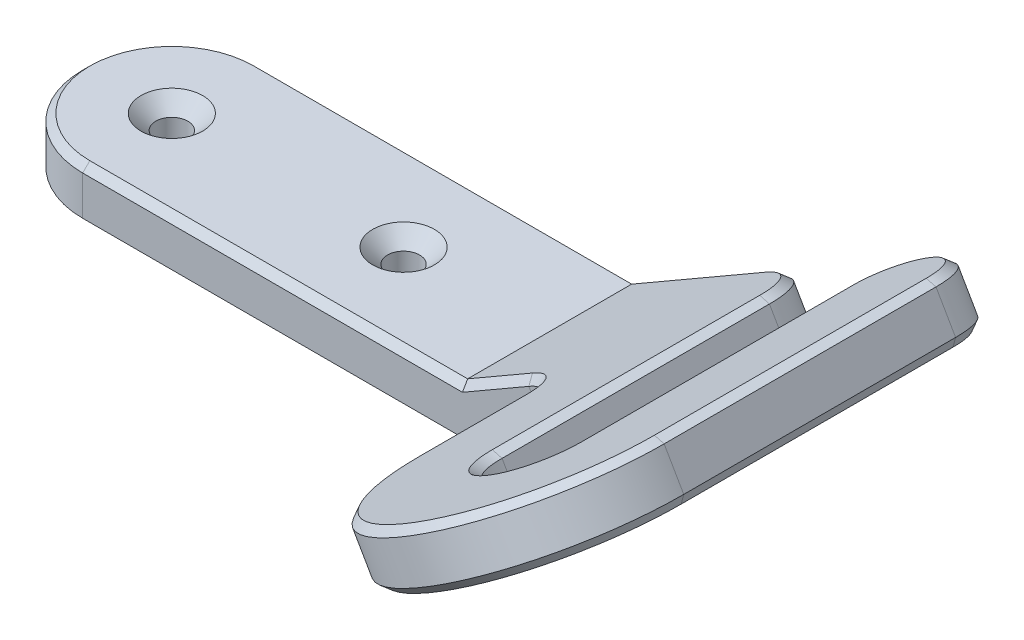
ISO-10303-21;
HEADER;
FILE_DESCRIPTION(('STEP AP214'),'2;1');
FILE_NAME('part.step','',(''),(''),'','','');
FILE_SCHEMA(('AUTOMOTIVE_DESIGN { 1 0 10303 214 1 1 1 1 }'));
ENDSEC;
DATA;
#1=APPLICATION_CONTEXT('core data for automotive mechanical design processes');
#2=APPLICATION_PROTOCOL_DEFINITION('international standard','automotive_design',2000,#1);
#3=PRODUCT_CONTEXT('',#1,'mechanical');
#4=PRODUCT('Part','Part','',(#3));
#5=PRODUCT_RELATED_PRODUCT_CATEGORY('part','',(#4));
#6=PRODUCT_DEFINITION_FORMATION('','',#4);
#7=PRODUCT_DEFINITION_CONTEXT('part definition',#1,'design');
#8=PRODUCT_DEFINITION('design','',#6,#7);
#9=PRODUCT_DEFINITION_SHAPE('','',#8);
#10=(LENGTH_UNIT() NAMED_UNIT(*) SI_UNIT(.MILLI.,.METRE.));
#11=(NAMED_UNIT(*) PLANE_ANGLE_UNIT() SI_UNIT($,.RADIAN.));
#12=(NAMED_UNIT(*) SI_UNIT($,.STERADIAN.) SOLID_ANGLE_UNIT());
#13=UNCERTAINTY_MEASURE_WITH_UNIT(LENGTH_MEASURE(1.E-05),#10,'distance_accuracy_value','');
#14=(GEOMETRIC_REPRESENTATION_CONTEXT(3) GLOBAL_UNCERTAINTY_ASSIGNED_CONTEXT((#13)) GLOBAL_UNIT_ASSIGNED_CONTEXT((#10,
#11,#12)) REPRESENTATION_CONTEXT('',''));
#15=CARTESIAN_POINT('',(0.,0.,0.));
#16=DIRECTION('',(0.,0.,1.));
#17=DIRECTION('',(1.,0.,0.));
#18=AXIS2_PLACEMENT_3D('',#15,#16,#17);
#19=CARTESIAN_POINT('',(-110.,15.,0.));
#20=DIRECTION('',(0.,1.,0.));
#21=DIRECTION('',(0.,0.,1.));
#22=AXIS2_PLACEMENT_3D('',#19,#20,#21);
#23=CYLINDRICAL_SURFACE('',#22,25.);
#24=DIRECTION('',(0.,1.,0.));
#25=VECTOR('',#24,1.);
#26=CARTESIAN_POINT('',(-110.,12.4999999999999,-25.));
#27=LINE('',#26,#25);
#28=CARTESIAN_POINT('',(-110.,1.99999999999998,-25.));
#29=VERTEX_POINT('',#28);
#30=CARTESIAN_POINT('',(-110.,13.,-25.));
#31=VERTEX_POINT('',#30);
#32=EDGE_CURVE('E220',#29,#31,#27,.T.);
#33=ORIENTED_EDGE('',*,*,#32,.F.);
#34=CARTESIAN_POINT('',(-110.,1.99999999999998,0.));
#35=DIRECTION('',(0.,1.,0.));
#36=DIRECTION('',(0.,0.,1.));
#37=AXIS2_PLACEMENT_3D('',#34,#35,#36);
#38=CIRCLE('',#37,25.);
#39=CARTESIAN_POINT('',(-110.,1.99999999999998,25.));
#40=VERTEX_POINT('',#39);
#41=EDGE_CURVE('E261',#29,#40,#38,.T.);
#42=ORIENTED_EDGE('',*,*,#41,.T.);
#43=DIRECTION('',(0.,-1.,0.));
#44=VECTOR('',#43,1.);
#45=CARTESIAN_POINT('',(-110.,15.,25.));
#46=LINE('',#45,#44);
#47=CARTESIAN_POINT('',(-110.,13.,25.));
#48=VERTEX_POINT('',#47);
#49=EDGE_CURVE('E305',#48,#40,#46,.T.);
#50=ORIENTED_EDGE('',*,*,#49,.F.);
#51=CARTESIAN_POINT('',(-110.,13.,0.));
#52=DIRECTION('',(0.,1.,0.));
#53=DIRECTION('',(0.,0.,1.));
#54=AXIS2_PLACEMENT_3D('',#51,#52,#53);
#55=CIRCLE('',#54,25.);
#56=EDGE_CURVE('E259',#48,#31,#55,.F.);
#57=ORIENTED_EDGE('',*,*,#56,.T.);
#58=EDGE_LOOP('',(#33,#42,#50,#57));
#59=FACE_BOUND('',#58,.T.);
#60=ADVANCED_FACE('F28',(#59),#23,.T.);
#61=CARTESIAN_POINT('',(0.,0.,25.));
#62=DIRECTION('',(-0.499999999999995,0.866025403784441,0.));
#63=DIRECTION('',(-0.866025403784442,-0.499999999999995,0.));
#64=AXIS2_PLACEMENT_3D('',#61,#62,#63);
#65=PLANE('',#64);
#66=DIRECTION('',(0.,0.,-1.));
#67=VECTOR('',#66,1.);
#68=CARTESIAN_POINT('',(0.,0.,25.));
#69=LINE('',#68,#67);
#70=CARTESIAN_POINT('',(0.,0.,23.));
#71=VERTEX_POINT('',#70);
#72=CARTESIAN_POINT('',(0.,0.,-23.));
#73=VERTEX_POINT('',#72);
#74=EDGE_CURVE('E212',#71,#73,#69,.T.);
#75=ORIENTED_EDGE('',*,*,#74,.T.);
#76=DIRECTION('',(0.866025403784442,0.499999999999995,0.));
#77=VECTOR('',#76,1.);
#78=CARTESIAN_POINT('',(41.136206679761,23.7499999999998,-23.));
#79=LINE('',#78,#77);
#80=CARTESIAN_POINT('',(41.136206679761,23.7499999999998,-23.));
#81=VERTEX_POINT('',#80);
#82=EDGE_CURVE('E440',#73,#81,#79,.T.);
#83=ORIENTED_EDGE('',*,*,#82,.T.);
#84=CARTESIAN_POINT('',(41.136206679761,23.7499999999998,-10.));
#85=DIRECTION('',(-0.499999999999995,0.866025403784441,0.));
#86=DIRECTION('',(-0.866025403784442,-0.499999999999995,0.));
#87=AXIS2_PLACEMENT_3D('',#84,#85,#86);
#88=CIRCLE('',#87,13.);
#89=CARTESIAN_POINT('',(52.3945369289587,30.2499999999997,-10.));
#90=VERTEX_POINT('',#89);
#91=EDGE_CURVE('E438',#81,#90,#88,.F.);
#92=ORIENTED_EDGE('',*,*,#91,.T.);
#93=DIRECTION('',(0.,0.,1.));
#94=VECTOR('',#93,1.);
#95=CARTESIAN_POINT('',(52.3945369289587,30.2499999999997,65.));
#96=LINE('',#95,#94);
#97=CARTESIAN_POINT('',(52.3945369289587,30.2499999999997,65.));
#98=VERTEX_POINT('',#97);
#99=EDGE_CURVE('E436',#90,#98,#96,.T.);
#100=ORIENTED_EDGE('',*,*,#99,.T.);
#101=CARTESIAN_POINT('',(64.9519052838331,37.4999999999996,65.));
#102=DIRECTION('',(-0.499999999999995,0.866025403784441,0.));
#103=DIRECTION('',(-0.866025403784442,-0.499999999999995,0.));
#104=AXIS2_PLACEMENT_3D('',#101,#102,#103);
#105=CIRCLE('',#104,14.5);
#106=CARTESIAN_POINT('',(77.5092736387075,44.7499999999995,65.));
#107=VERTEX_POINT('',#106);
#108=EDGE_CURVE('E434',#98,#107,#105,.T.);
#109=ORIENTED_EDGE('',*,*,#108,.T.);
#110=DIRECTION('',(0.,0.,-1.));
#111=VECTOR('',#110,1.);
#112=CARTESIAN_POINT('',(77.5092736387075,44.7499999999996,-11.25));
#113=LINE('',#112,#111);
#114=CARTESIAN_POINT('',(77.5092736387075,44.7499999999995,-11.25));
#115=VERTEX_POINT('',#114);
#116=EDGE_CURVE('E432',#107,#115,#113,.T.);
#117=ORIENTED_EDGE('',*,*,#116,.T.);
#118=CARTESIAN_POINT('',(87.6850721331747,50.6249999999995,-11.25));
#119=DIRECTION('',(-0.499999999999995,0.866025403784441,0.));
#120=DIRECTION('',(-0.866025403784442,-0.499999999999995,0.));
#121=AXIS2_PLACEMENT_3D('',#118,#119,#120);
#122=CIRCLE('',#121,11.75);
#123=CARTESIAN_POINT('',(97.8608706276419,56.4999999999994,-11.25));
#124=VERTEX_POINT('',#123);
#125=EDGE_CURVE('E430',#115,#124,#122,.F.);
#126=ORIENTED_EDGE('',*,*,#125,.T.);
#127=DIRECTION('',(0.,0.,1.));
#128=VECTOR('',#127,1.);
#129=CARTESIAN_POINT('',(97.8608706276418,56.4999999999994,65.));
#130=LINE('',#129,#128);
#131=CARTESIAN_POINT('',(97.8608706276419,56.4999999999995,65.));
#132=VERTEX_POINT('',#131);
#133=EDGE_CURVE('E428',#124,#132,#130,.T.);
#134=ORIENTED_EDGE('',*,*,#133,.T.);
#135=CARTESIAN_POINT('',(64.9519052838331,37.4999999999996,65.));
#136=DIRECTION('',(-0.499999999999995,0.866025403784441,0.));
#137=DIRECTION('',(-0.866025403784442,-0.499999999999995,0.));
#138=AXIS2_PLACEMENT_3D('',#135,#136,#137);
#139=CIRCLE('',#138,38.0000000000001);
#140=CARTESIAN_POINT('',(32.0429399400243,18.4999999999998,65.));
#141=VERTEX_POINT('',#140);
#142=EDGE_CURVE('E426',#132,#141,#139,.F.);
#143=ORIENTED_EDGE('',*,*,#142,.T.);
#144=DIRECTION('',(0.,0.,-1.));
#145=VECTOR('',#144,1.);
#146=CARTESIAN_POINT('',(32.0429399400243,18.4999999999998,35.));
#147=LINE('',#146,#145);
#148=CARTESIAN_POINT('',(32.0429399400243,18.4999999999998,35.));
#149=VERTEX_POINT('',#148);
#150=EDGE_CURVE('E424',#141,#149,#147,.T.);
#151=ORIENTED_EDGE('',*,*,#150,.T.);
#152=CARTESIAN_POINT('',(21.650635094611,12.4999999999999,35.));
#153=DIRECTION('',(-0.499999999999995,0.866025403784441,0.));
#154=DIRECTION('',(-0.866025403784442,-0.499999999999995,0.));
#155=AXIS2_PLACEMENT_3D('',#152,#153,#154);
#156=CIRCLE('',#155,12.);
#157=CARTESIAN_POINT('',(21.650635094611,12.4999999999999,23.));
#158=VERTEX_POINT('',#157);
#159=EDGE_CURVE('E215',#149,#158,#156,.T.);
#160=ORIENTED_EDGE('',*,*,#159,.T.);
#161=DIRECTION('',(-0.866025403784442,-0.499999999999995,0.));
#162=VECTOR('',#161,1.);
#163=CARTESIAN_POINT('',(0.,0.,23.));
#164=LINE('',#163,#162);
#165=EDGE_CURVE('E208',#158,#71,#164,.T.);
#166=ORIENTED_EDGE('',*,*,#165,.T.);
#167=EDGE_LOOP('',(#75,#83,#92,#100,#109,#117,#126,#134,#143,#151,#160,#166));
#168=FACE_BOUND('',#167,.T.);
#169=ADVANCED_FACE('F210',(#168),#65,.F.);
#170=CARTESIAN_POINT('',(-7.49999999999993,12.9903810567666,25.));
#171=DIRECTION('',(-0.499999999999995,0.866025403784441,0.));
#172=DIRECTION('',(-0.866025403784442,-0.499999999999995,0.));
#173=AXIS2_PLACEMENT_3D('',#170,#171,#172);
#174=PLANE('',#173);
#175=CARTESIAN_POINT('',(33.636206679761,36.7403810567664,-10.));
#176=DIRECTION('',(-0.499999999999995,0.866025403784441,0.));
#177=DIRECTION('',(-0.866025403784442,-0.499999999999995,0.));
#178=AXIS2_PLACEMENT_3D('',#175,#176,#177);
#179=CIRCLE('',#178,13.);
#180=CARTESIAN_POINT('',(44.8945369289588,43.2403810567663,-10.));
#181=VERTEX_POINT('',#180);
#182=CARTESIAN_POINT('',(33.636206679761,36.7403810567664,-23.));
#183=VERTEX_POINT('',#182);
#184=EDGE_CURVE('E288',#181,#183,#179,.T.);
#185=ORIENTED_EDGE('',*,*,#184,.T.);
#186=DIRECTION('',(-0.866025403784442,-0.499999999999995,0.));
#187=VECTOR('',#186,1.);
#188=CARTESIAN_POINT('',(-7.49999999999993,12.9903810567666,-23.));
#189=LINE('',#188,#187);
#190=CARTESIAN_POINT('',(-4.01923788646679,15.,-23.));
#191=VERTEX_POINT('',#190);
#192=EDGE_CURVE('E290',#183,#191,#189,.T.);
#193=ORIENTED_EDGE('',*,*,#192,.T.);
#194=DIRECTION('',(0.,0.,-1.));
#195=VECTOR('',#194,1.);
#196=CARTESIAN_POINT('',(-4.01923788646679,15.,25.));
#197=LINE('',#196,#195);
#198=CARTESIAN_POINT('',(-4.01923788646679,15.,23.));
#199=VERTEX_POINT('',#198);
#200=EDGE_CURVE('E229',#199,#191,#197,.T.);
#201=ORIENTED_EDGE('',*,*,#200,.F.);
#202=DIRECTION('',(0.866025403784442,0.499999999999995,0.));
#203=VECTOR('',#202,1.);
#204=CARTESIAN_POINT('',(14.1506350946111,25.4903810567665,23.));
#205=LINE('',#204,#203);
#206=CARTESIAN_POINT('',(14.1506350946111,25.4903810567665,23.));
#207=VERTEX_POINT('',#206);
#208=EDGE_CURVE('E270',#199,#207,#205,.T.);
#209=ORIENTED_EDGE('',*,*,#208,.T.);
#210=CARTESIAN_POINT('',(14.1506350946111,25.4903810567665,35.));
#211=DIRECTION('',(-0.499999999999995,0.866025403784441,0.));
#212=DIRECTION('',(-0.866025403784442,-0.499999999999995,0.));
#213=AXIS2_PLACEMENT_3D('',#210,#211,#212);
#214=CIRCLE('',#213,12.);
#215=CARTESIAN_POINT('',(24.5429399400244,31.4903810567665,35.));
#216=VERTEX_POINT('',#215);
#217=EDGE_CURVE('E272',#207,#216,#214,.F.);
#218=ORIENTED_EDGE('',*,*,#217,.T.);
#219=DIRECTION('',(0.,0.,1.));
#220=VECTOR('',#219,1.);
#221=CARTESIAN_POINT('',(24.5429399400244,31.4903810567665,25.));
#222=LINE('',#221,#220);
#223=CARTESIAN_POINT('',(24.5429399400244,31.4903810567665,65.));
#224=VERTEX_POINT('',#223);
#225=EDGE_CURVE('E274',#216,#224,#222,.T.);
#226=ORIENTED_EDGE('',*,*,#225,.T.);
#227=CARTESIAN_POINT('',(57.4519052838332,50.4903810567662,65.));
#228=DIRECTION('',(-0.499999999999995,0.866025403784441,0.));
#229=DIRECTION('',(-0.866025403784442,-0.499999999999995,0.));
#230=AXIS2_PLACEMENT_3D('',#227,#228,#229);
#231=CIRCLE('',#230,38.);
#232=CARTESIAN_POINT('',(90.3608706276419,69.490381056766,65.));
#233=VERTEX_POINT('',#232);
#234=EDGE_CURVE('E276',#224,#233,#231,.T.);
#235=ORIENTED_EDGE('',*,*,#234,.T.);
#236=DIRECTION('',(0.,0.,-1.));
#237=VECTOR('',#236,1.);
#238=CARTESIAN_POINT('',(90.3608706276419,69.4903810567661,25.));
#239=LINE('',#238,#237);
#240=CARTESIAN_POINT('',(90.3608706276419,69.4903810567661,-11.25));
#241=VERTEX_POINT('',#240);
#242=EDGE_CURVE('E278',#233,#241,#239,.T.);
#243=ORIENTED_EDGE('',*,*,#242,.T.);
#244=CARTESIAN_POINT('',(80.1850721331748,63.6153810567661,-11.25));
#245=DIRECTION('',(-0.499999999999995,0.866025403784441,0.));
#246=DIRECTION('',(-0.866025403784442,-0.499999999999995,0.));
#247=AXIS2_PLACEMENT_3D('',#244,#245,#246);
#248=CIRCLE('',#247,11.75);
#249=CARTESIAN_POINT('',(70.0092736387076,57.7403810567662,-11.25));
#250=VERTEX_POINT('',#249);
#251=EDGE_CURVE('E280',#241,#250,#248,.T.);
#252=ORIENTED_EDGE('',*,*,#251,.T.);
#253=DIRECTION('',(0.,0.,1.));
#254=VECTOR('',#253,1.);
#255=CARTESIAN_POINT('',(70.0092736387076,57.7403810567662,25.));
#256=LINE('',#255,#254);
#257=CARTESIAN_POINT('',(70.0092736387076,57.7403810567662,65.));
#258=VERTEX_POINT('',#257);
#259=EDGE_CURVE('E282',#250,#258,#256,.T.);
#260=ORIENTED_EDGE('',*,*,#259,.T.);
#261=CARTESIAN_POINT('',(57.4519052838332,50.4903810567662,65.));
#262=DIRECTION('',(-0.499999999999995,0.866025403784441,0.));
#263=DIRECTION('',(-0.866025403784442,-0.499999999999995,0.));
#264=AXIS2_PLACEMENT_3D('',#261,#262,#263);
#265=CIRCLE('',#264,14.5);
#266=CARTESIAN_POINT('',(44.8945369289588,43.2403810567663,65.));
#267=VERTEX_POINT('',#266);
#268=EDGE_CURVE('E284',#258,#267,#265,.F.);
#269=ORIENTED_EDGE('',*,*,#268,.T.);
#270=DIRECTION('',(0.,0.,-1.));
#271=VECTOR('',#270,1.);
#272=CARTESIAN_POINT('',(44.8945369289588,43.2403810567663,25.));
#273=LINE('',#272,#271);
#274=EDGE_CURVE('E286',#267,#181,#273,.T.);
#275=ORIENTED_EDGE('',*,*,#274,.T.);
#276=EDGE_LOOP('',(#185,#193,#201,#209,#218,#226,#235,#243,#252,#260,#269,#275));
#277=FACE_BOUND('',#276,.T.);
#278=ADVANCED_FACE('F302',(#277),#174,.T.);
#279=CARTESIAN_POINT('',(0.,15.,25.));
#280=DIRECTION('',(0.,1.,0.));
#281=DIRECTION('',(-1.,0.,0.));
#282=AXIS2_PLACEMENT_3D('',#279,#280,#281);
#283=PLANE('',#282);
#284=CARTESIAN_POINT('',(-45.,15.,0.));
#285=DIRECTION('',(0.,1.,0.));
#286=DIRECTION('',(0.,0.,1.));
#287=AXIS2_PLACEMENT_3D('',#284,#285,#286);
#288=CIRCLE('',#287,8.65);
#289=CARTESIAN_POINT('',(-45.,15.,8.64999999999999));
#290=VERTEX_POINT('',#289);
#291=EDGE_CURVE('E378',#290,#290,#288,.T.);
#292=ORIENTED_EDGE('',*,*,#291,.F.);
#293=EDGE_LOOP('',(#292));
#294=FACE_BOUND('',#293,.T.);
#295=CARTESIAN_POINT('',(-110.,15.,0.));
#296=DIRECTION('',(0.,1.,0.));
#297=DIRECTION('',(0.,0.,1.));
#298=AXIS2_PLACEMENT_3D('',#295,#296,#297);
#299=CIRCLE('',#298,8.65000000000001);
#300=CARTESIAN_POINT('',(-110.,15.,8.65000000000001));
#301=VERTEX_POINT('',#300);
#302=EDGE_CURVE('E387',#301,#301,#299,.T.);
#303=ORIENTED_EDGE('',*,*,#302,.F.);
#304=EDGE_LOOP('',(#303));
#305=FACE_BOUND('',#304,.T.);
#306=ORIENTED_EDGE('',*,*,#200,.T.);
#307=DIRECTION('',(-1.,0.,0.));
#308=VECTOR('',#307,1.);
#309=CARTESIAN_POINT('',(0.,15.,-23.));
#310=LINE('',#309,#308);
#311=CARTESIAN_POINT('',(-110.,15.,-23.));
#312=VERTEX_POINT('',#311);
#313=EDGE_CURVE('E11',#191,#312,#310,.T.);
#314=ORIENTED_EDGE('',*,*,#313,.T.);
#315=CARTESIAN_POINT('',(-110.,15.,0.));
#316=DIRECTION('',(0.,1.,0.));
#317=DIRECTION('',(-1.,0.,0.));
#318=AXIS2_PLACEMENT_3D('',#315,#316,#317);
#319=CIRCLE('',#318,23.);
#320=CARTESIAN_POINT('',(-110.,15.,23.));
#321=VERTEX_POINT('',#320);
#322=EDGE_CURVE('E35',#312,#321,#319,.T.);
#323=ORIENTED_EDGE('',*,*,#322,.T.);
#324=DIRECTION('',(1.,0.,0.));
#325=VECTOR('',#324,1.);
#326=CARTESIAN_POINT('',(-4.01923788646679,15.,23.));
#327=LINE('',#326,#325);
#328=EDGE_CURVE('E293',#321,#199,#327,.T.);
#329=ORIENTED_EDGE('',*,*,#328,.T.);
#330=EDGE_LOOP('',(#306,#314,#323,#329));
#331=FACE_BOUND('',#330,.T.);
#332=ADVANCED_FACE('F295',(#294,#305,#331),#283,.T.);
#333=CARTESIAN_POINT('',(0.,0.,25.));
#334=DIRECTION('',(0.,1.,0.));
#335=DIRECTION('',(-1.,0.,0.));
#336=AXIS2_PLACEMENT_3D('',#333,#334,#335);
#337=PLANE('',#336);
#338=CARTESIAN_POINT('',(-45.,0.,0.));
#339=DIRECTION('',(0.,1.,0.));
#340=DIRECTION('',(0.,0.,1.));
#341=AXIS2_PLACEMENT_3D('',#338,#339,#340);
#342=CIRCLE('',#341,4.5);
#343=CARTESIAN_POINT('',(-45.,0.,4.49999999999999));
#344=VERTEX_POINT('',#343);
#345=EDGE_CURVE('E372',#344,#344,#342,.T.);
#346=ORIENTED_EDGE('',*,*,#345,.T.);
#347=EDGE_LOOP('',(#346));
#348=FACE_BOUND('',#347,.T.);
#349=CARTESIAN_POINT('',(-110.,0.,0.));
#350=DIRECTION('',(0.,1.,0.));
#351=DIRECTION('',(0.,0.,1.));
#352=AXIS2_PLACEMENT_3D('',#349,#350,#351);
#353=CIRCLE('',#352,4.5);
#354=CARTESIAN_POINT('',(-110.,0.,4.5));
#355=VERTEX_POINT('',#354);
#356=EDGE_CURVE('E381',#355,#355,#353,.T.);
#357=ORIENTED_EDGE('',*,*,#356,.T.);
#358=EDGE_LOOP('',(#357));
#359=FACE_BOUND('',#358,.T.);
#360=CARTESIAN_POINT('',(-110.,0.,0.));
#361=DIRECTION('',(0.,1.,0.));
#362=DIRECTION('',(-1.,0.,0.));
#363=AXIS2_PLACEMENT_3D('',#360,#361,#362);
#364=CIRCLE('',#363,23.);
#365=CARTESIAN_POINT('',(-110.,0.,23.));
#366=VERTEX_POINT('',#365);
#367=CARTESIAN_POINT('',(-110.,0.,-23.));
#368=VERTEX_POINT('',#367);
#369=EDGE_CURVE('E246',#366,#368,#364,.F.);
#370=ORIENTED_EDGE('',*,*,#369,.T.);
#371=DIRECTION('',(1.,0.,0.));
#372=VECTOR('',#371,1.);
#373=CARTESIAN_POINT('',(0.,0.,-23.));
#374=LINE('',#373,#372);
#375=EDGE_CURVE('E228',#368,#73,#374,.T.);
#376=ORIENTED_EDGE('',*,*,#375,.T.);
#377=ORIENTED_EDGE('',*,*,#74,.F.);
#378=DIRECTION('',(-1.,0.,0.));
#379=VECTOR('',#378,1.);
#380=CARTESIAN_POINT('',(0.,0.,23.));
#381=LINE('',#380,#379);
#382=EDGE_CURVE('E225',#71,#366,#381,.T.);
#383=ORIENTED_EDGE('',*,*,#382,.T.);
#384=EDGE_LOOP('',(#370,#376,#377,#383));
#385=FACE_BOUND('',#384,.T.);
#386=ADVANCED_FACE('F223',(#348,#359,#385),#337,.F.);
#387=CARTESIAN_POINT('',(21.650635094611,12.4999999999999,25.));
#388=DIRECTION('',(0.,0.,-1.));
#389=DIRECTION('',(-1.,0.,0.));
#390=AXIS2_PLACEMENT_3D('',#387,#388,#389);
#391=PLANE('',#390);
#392=DIRECTION('',(1.,0.,0.));
#393=VECTOR('',#392,1.);
#394=CARTESIAN_POINT('',(21.650635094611,2.,25.));
#395=LINE('',#394,#393);
#396=CARTESIAN_POINT('',(-0.535898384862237,1.99999999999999,25.));
#397=VERTEX_POINT('',#396);
#398=EDGE_CURVE('E267',#40,#397,#395,.T.);
#399=ORIENTED_EDGE('',*,*,#398,.T.);
#400=DIRECTION('',(0.866025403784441,0.499999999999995,0.));
#401=VECTOR('',#400,1.);
#402=CARTESIAN_POINT('',(20.6506350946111,14.2320508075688,25.));
#403=LINE('',#402,#401);
#404=CARTESIAN_POINT('',(20.6506350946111,14.2320508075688,25.));
#405=VERTEX_POINT('',#404);
#406=EDGE_CURVE('E236',#397,#405,#403,.T.);
#407=ORIENTED_EDGE('',*,*,#406,.T.);
#408=DIRECTION('',(0.499999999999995,-0.866025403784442,0.));
#409=VECTOR('',#408,1.);
#410=CARTESIAN_POINT('',(14.1506350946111,25.4903810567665,25.));
#411=LINE('',#410,#409);
#412=CARTESIAN_POINT('',(15.1506350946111,23.7583302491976,25.));
#413=VERTEX_POINT('',#412);
#414=EDGE_CURVE('E230',#413,#405,#411,.T.);
#415=ORIENTED_EDGE('',*,*,#414,.F.);
#416=DIRECTION('',(-0.866025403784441,-0.499999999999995,0.));
#417=VECTOR('',#416,1.);
#418=CARTESIAN_POINT('',(-3.01923788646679,13.2679491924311,25.));
#419=LINE('',#418,#417);
#420=CARTESIAN_POINT('',(-3.48333950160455,13.,25.));
#421=VERTEX_POINT('',#420);
#422=EDGE_CURVE('E265',#413,#421,#419,.T.);
#423=ORIENTED_EDGE('',*,*,#422,.T.);
#424=DIRECTION('',(-1.,0.,0.));
#425=VECTOR('',#424,1.);
#426=CARTESIAN_POINT('',(-110.,13.,25.));
#427=LINE('',#426,#425);
#428=EDGE_CURVE('E263',#421,#48,#427,.T.);
#429=ORIENTED_EDGE('',*,*,#428,.T.);
#430=ORIENTED_EDGE('',*,*,#49,.T.);
#431=EDGE_LOOP('',(#399,#407,#415,#423,#429,#430));
#432=FACE_BOUND('',#431,.T.);
#433=ADVANCED_FACE('F498',(#432),#391,.F.);
#434=CARTESIAN_POINT('',(21.650635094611,12.4999999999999,-25.));
#435=DIRECTION('',(0.,0.,-1.));
#436=DIRECTION('',(-1.,0.,0.));
#437=AXIS2_PLACEMENT_3D('',#434,#435,#436);
#438=PLANE('',#437);
#439=DIRECTION('',(-0.499999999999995,0.866025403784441,0.));
#440=VECTOR('',#439,1.);
#441=CARTESIAN_POINT('',(120.19314818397,-113.180639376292,-25.));
#442=LINE('',#441,#440);
#443=CARTESIAN_POINT('',(40.136206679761,25.4820508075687,-25.));
#444=VERTEX_POINT('',#443);
#445=CARTESIAN_POINT('',(34.636206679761,35.0083302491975,-25.));
#446=VERTEX_POINT('',#445);
#447=EDGE_CURVE('E391',#444,#446,#442,.T.);
#448=ORIENTED_EDGE('',*,*,#447,.F.);
#449=DIRECTION('',(-0.866025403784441,-0.499999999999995,0.));
#450=VECTOR('',#449,1.);
#451=CARTESIAN_POINT('',(-0.999999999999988,1.73205080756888,-25.));
#452=LINE('',#451,#450);
#453=CARTESIAN_POINT('',(-0.53589838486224,1.99999999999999,-25.));
#454=VERTEX_POINT('',#453);
#455=EDGE_CURVE('E449',#444,#454,#452,.T.);
#456=ORIENTED_EDGE('',*,*,#455,.T.);
#457=DIRECTION('',(-1.,0.,0.));
#458=VECTOR('',#457,1.);
#459=CARTESIAN_POINT('',(-110.,1.99999999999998,-25.));
#460=LINE('',#459,#458);
#461=EDGE_CURVE('E447',#454,#29,#460,.T.);
#462=ORIENTED_EDGE('',*,*,#461,.T.);
#463=ORIENTED_EDGE('',*,*,#32,.T.);
#464=DIRECTION('',(1.,0.,0.));
#465=VECTOR('',#464,1.);
#466=CARTESIAN_POINT('',(21.650635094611,13.,-25.));
#467=LINE('',#466,#465);
#468=CARTESIAN_POINT('',(-3.48333950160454,13.,-25.));
#469=VERTEX_POINT('',#468);
#470=EDGE_CURVE('E442',#31,#469,#467,.T.);
#471=ORIENTED_EDGE('',*,*,#470,.T.);
#472=DIRECTION('',(0.866025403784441,0.499999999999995,0.));
#473=VECTOR('',#472,1.);
#474=CARTESIAN_POINT('',(15.1506350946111,23.7583302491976,-25.));
#475=LINE('',#474,#473);
#476=EDGE_CURVE('E444',#469,#446,#475,.T.);
#477=ORIENTED_EDGE('',*,*,#476,.T.);
#478=EDGE_LOOP('',(#448,#456,#462,#463,#471,#477));
#479=FACE_BOUND('',#478,.T.);
#480=ADVANCED_FACE('F594',(#479),#438,.T.);
#481=CARTESIAN_POINT('',(120.19314818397,-113.180639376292,-10.));
#482=DIRECTION('',(-0.499999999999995,0.866025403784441,0.));
#483=DIRECTION('',(-0.866025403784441,-0.499999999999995,0.));
#484=AXIS2_PLACEMENT_3D('',#481,#482,#483);
#485=CYLINDRICAL_SURFACE('',#484,15.);
#486=DIRECTION('',(-0.499999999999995,0.866025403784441,0.));
#487=VECTOR('',#486,1.);
#488=CARTESIAN_POINT('',(133.183529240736,-105.680639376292,-10.));
#489=LINE('',#488,#487);
#490=CARTESIAN_POINT('',(53.1265877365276,32.9820508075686,-10.));
#491=VERTEX_POINT('',#490);
#492=CARTESIAN_POINT('',(47.6265877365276,42.5083302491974,-10.));
#493=VERTEX_POINT('',#492);
#494=EDGE_CURVE('E394',#491,#493,#489,.T.);
#495=ORIENTED_EDGE('',*,*,#494,.F.);
#496=CARTESIAN_POINT('',(40.136206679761,25.4820508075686,-10.));
#497=DIRECTION('',(-0.499999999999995,0.866025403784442,0.));
#498=DIRECTION('',(-0.866025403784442,-0.499999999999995,0.));
#499=AXIS2_PLACEMENT_3D('',#496,#497,#498);
#500=CIRCLE('',#499,15.);
#501=EDGE_CURVE('E454',#491,#444,#500,.T.);
#502=ORIENTED_EDGE('',*,*,#501,.T.);
#503=ORIENTED_EDGE('',*,*,#447,.T.);
#504=CARTESIAN_POINT('',(34.636206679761,35.0083302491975,-10.));
#505=DIRECTION('',(-0.499999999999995,0.866025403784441,0.));
#506=DIRECTION('',(-0.866025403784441,-0.499999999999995,0.));
#507=AXIS2_PLACEMENT_3D('',#504,#505,#506);
#508=CIRCLE('',#507,15.);
#509=EDGE_CURVE('E452',#446,#493,#508,.F.);
#510=ORIENTED_EDGE('',*,*,#509,.T.);
#511=EDGE_LOOP('',(#495,#502,#503,#510));
#512=FACE_BOUND('',#511,.T.);
#513=ADVANCED_FACE('F593',(#512),#485,.T.);
#514=CARTESIAN_POINT('',(133.183529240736,-105.680639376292,-10.));
#515=DIRECTION('',(0.866025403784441,0.499999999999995,0.));
#516=DIRECTION('',(-0.499999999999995,0.866025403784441,0.));
#517=AXIS2_PLACEMENT_3D('',#514,#515,#516);
#518=PLANE('',#517);
#519=DIRECTION('',(-0.499999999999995,0.866025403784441,0.));
#520=VECTOR('',#519,1.);
#521=CARTESIAN_POINT('',(133.183529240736,-105.680639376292,65.));
#522=LINE('',#521,#520);
#523=CARTESIAN_POINT('',(53.1265877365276,32.9820508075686,65.));
#524=VERTEX_POINT('',#523);
#525=CARTESIAN_POINT('',(47.6265877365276,42.5083302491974,65.));
#526=VERTEX_POINT('',#525);
#527=EDGE_CURVE('E397',#524,#526,#522,.T.);
#528=ORIENTED_EDGE('',*,*,#527,.F.);
#529=DIRECTION('',(0.,0.,-1.));
#530=VECTOR('',#529,1.);
#531=CARTESIAN_POINT('',(53.1265877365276,32.9820508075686,-10.));
#532=LINE('',#531,#530);
#533=EDGE_CURVE('E458',#524,#491,#532,.T.);
#534=ORIENTED_EDGE('',*,*,#533,.T.);
#535=ORIENTED_EDGE('',*,*,#494,.T.);
#536=DIRECTION('',(0.,0.,1.));
#537=VECTOR('',#536,1.);
#538=CARTESIAN_POINT('',(47.6265877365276,42.5083302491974,-10.));
#539=LINE('',#538,#537);
#540=EDGE_CURVE('E456',#493,#526,#539,.T.);
#541=ORIENTED_EDGE('',*,*,#540,.T.);
#542=EDGE_LOOP('',(#528,#534,#535,#541));
#543=FACE_BOUND('',#542,.T.);
#544=ADVANCED_FACE('F614',(#543),#518,.T.);
#545=CARTESIAN_POINT('',(144.008846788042,-99.4306393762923,65.));
#546=DIRECTION('',(-0.499999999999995,0.866025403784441,0.));
#547=DIRECTION('',(-0.866025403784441,-0.499999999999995,0.));
#548=AXIS2_PLACEMENT_3D('',#545,#546,#547);
#549=CYLINDRICAL_SURFACE('',#548,12.5);
#550=DIRECTION('',(-0.499999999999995,0.866025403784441,0.));
#551=VECTOR('',#550,1.);
#552=CARTESIAN_POINT('',(154.834164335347,-93.1806393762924,65.));
#553=LINE('',#552,#551);
#554=CARTESIAN_POINT('',(74.7772228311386,45.4820508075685,65.));
#555=VERTEX_POINT('',#554);
#556=CARTESIAN_POINT('',(69.2772228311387,55.0083302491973,65.));
#557=VERTEX_POINT('',#556);
#558=EDGE_CURVE('E400',#555,#557,#553,.T.);
#559=ORIENTED_EDGE('',*,*,#558,.F.);
#560=CARTESIAN_POINT('',(63.9519052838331,39.2320508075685,65.));
#561=DIRECTION('',(-0.499999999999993,0.866025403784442,0.));
#562=DIRECTION('',(-0.866025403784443,-0.499999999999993,0.));
#563=AXIS2_PLACEMENT_3D('',#560,#561,#562);
#564=CIRCLE('',#563,12.5);
#565=EDGE_CURVE('E462',#555,#524,#564,.F.);
#566=ORIENTED_EDGE('',*,*,#565,.T.);
#567=ORIENTED_EDGE('',*,*,#527,.T.);
#568=CARTESIAN_POINT('',(58.4519052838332,48.7583302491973,65.));
#569=DIRECTION('',(-0.499999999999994,0.866025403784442,0.));
#570=DIRECTION('',(-0.866025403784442,-0.499999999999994,0.));
#571=AXIS2_PLACEMENT_3D('',#568,#569,#570);
#572=CIRCLE('',#571,12.5);
#573=EDGE_CURVE('E460',#526,#557,#572,.T.);
#574=ORIENTED_EDGE('',*,*,#573,.T.);
#575=EDGE_LOOP('',(#559,#566,#567,#574));
#576=FACE_BOUND('',#575,.T.);
#577=ADVANCED_FACE('F866',(#576),#549,.F.);
#578=CARTESIAN_POINT('',(154.834164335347,-93.1806393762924,65.));
#579=DIRECTION('',(-0.866025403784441,-0.499999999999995,0.));
#580=DIRECTION('',(0.499999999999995,-0.866025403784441,0.));
#581=AXIS2_PLACEMENT_3D('',#578,#579,#580);
#582=PLANE('',#581);
#583=DIRECTION('',(-0.499999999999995,0.866025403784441,0.));
#584=VECTOR('',#583,1.);
#585=CARTESIAN_POINT('',(154.834164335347,-93.1806393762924,-11.25));
#586=LINE('',#585,#584);
#587=CARTESIAN_POINT('',(74.7772228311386,45.4820508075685,-11.25));
#588=VERTEX_POINT('',#587);
#589=CARTESIAN_POINT('',(69.2772228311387,55.0083302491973,-11.25));
#590=VERTEX_POINT('',#589);
#591=EDGE_CURVE('E403',#588,#590,#586,.T.);
#592=ORIENTED_EDGE('',*,*,#591,.F.);
#593=DIRECTION('',(0.,0.,1.));
#594=VECTOR('',#593,1.);
#595=CARTESIAN_POINT('',(74.7772228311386,45.4820508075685,65.));
#596=LINE('',#595,#594);
#597=EDGE_CURVE('E466',#588,#555,#596,.T.);
#598=ORIENTED_EDGE('',*,*,#597,.T.);
#599=ORIENTED_EDGE('',*,*,#558,.T.);
#600=DIRECTION('',(0.,0.,-1.));
#601=VECTOR('',#600,1.);
#602=CARTESIAN_POINT('',(69.2772228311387,55.0083302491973,65.));
#603=LINE('',#602,#601);
#604=EDGE_CURVE('E464',#557,#590,#603,.T.);
#605=ORIENTED_EDGE('',*,*,#604,.T.);
#606=EDGE_LOOP('',(#592,#598,#599,#605));
#607=FACE_BOUND('',#606,.T.);
#608=ADVANCED_FACE('F859',(#607),#582,.T.);
#609=CARTESIAN_POINT('',(166.742013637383,-86.3056393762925,-11.25));
#610=DIRECTION('',(-0.499999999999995,0.866025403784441,0.));
#611=DIRECTION('',(-0.866025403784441,-0.499999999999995,0.));
#612=AXIS2_PLACEMENT_3D('',#609,#610,#611);
#613=CYLINDRICAL_SURFACE('',#612,13.75);
#614=DIRECTION('',(-0.499999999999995,0.866025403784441,0.));
#615=VECTOR('',#614,1.);
#616=CARTESIAN_POINT('',(178.649862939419,-79.4306393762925,-11.25));
#617=LINE('',#616,#615);
#618=CARTESIAN_POINT('',(98.5929214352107,59.2320508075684,-11.25));
#619=VERTEX_POINT('',#618);
#620=CARTESIAN_POINT('',(93.0929214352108,68.7583302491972,-11.25));
#621=VERTEX_POINT('',#620);
#622=EDGE_CURVE('E406',#619,#621,#617,.T.);
#623=ORIENTED_EDGE('',*,*,#622,.F.);
#624=CARTESIAN_POINT('',(86.6850721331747,52.3570508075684,-11.25));
#625=DIRECTION('',(-0.499999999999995,0.866025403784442,0.));
#626=DIRECTION('',(-0.866025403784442,-0.499999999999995,0.));
#627=AXIS2_PLACEMENT_3D('',#624,#625,#626);
#628=CIRCLE('',#627,13.75);
#629=EDGE_CURVE('E470',#619,#588,#628,.T.);
#630=ORIENTED_EDGE('',*,*,#629,.T.);
#631=ORIENTED_EDGE('',*,*,#591,.T.);
#632=CARTESIAN_POINT('',(81.1850721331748,61.8833302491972,-11.25));
#633=DIRECTION('',(-0.499999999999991,0.866025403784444,0.));
#634=DIRECTION('',(-0.866025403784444,-0.499999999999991,0.));
#635=AXIS2_PLACEMENT_3D('',#632,#633,#634);
#636=CIRCLE('',#635,13.75);
#637=EDGE_CURVE('E468',#590,#621,#636,.F.);
#638=ORIENTED_EDGE('',*,*,#637,.T.);
#639=EDGE_LOOP('',(#623,#630,#631,#638));
#640=FACE_BOUND('',#639,.T.);
#641=ADVANCED_FACE('F527',(#640),#613,.T.);
#642=CARTESIAN_POINT('',(178.649862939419,-79.4306393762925,-11.25));
#643=DIRECTION('',(0.866025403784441,0.499999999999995,0.));
#644=DIRECTION('',(-0.499999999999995,0.866025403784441,0.));
#645=AXIS2_PLACEMENT_3D('',#642,#643,#644);
#646=PLANE('',#645);
#647=DIRECTION('',(-0.499999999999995,0.866025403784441,0.));
#648=VECTOR('',#647,1.);
#649=CARTESIAN_POINT('',(178.649862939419,-79.4306393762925,65.));
#650=LINE('',#649,#648);
#651=CARTESIAN_POINT('',(98.5929214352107,59.2320508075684,65.));
#652=VERTEX_POINT('',#651);
#653=CARTESIAN_POINT('',(93.0929214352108,68.7583302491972,65.));
#654=VERTEX_POINT('',#653);
#655=EDGE_CURVE('E409',#652,#654,#650,.T.);
#656=ORIENTED_EDGE('',*,*,#655,.F.);
#657=DIRECTION('',(0.,0.,-1.));
#658=VECTOR('',#657,1.);
#659=CARTESIAN_POINT('',(98.5929214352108,59.2320508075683,-11.25));
#660=LINE('',#659,#658);
#661=EDGE_CURVE('E474',#652,#619,#660,.T.);
#662=ORIENTED_EDGE('',*,*,#661,.T.);
#663=ORIENTED_EDGE('',*,*,#622,.T.);
#664=DIRECTION('',(0.,0.,1.));
#665=VECTOR('',#664,1.);
#666=CARTESIAN_POINT('',(93.0929214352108,68.7583302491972,-11.25));
#667=LINE('',#666,#665);
#668=EDGE_CURVE('E472',#621,#654,#667,.T.);
#669=ORIENTED_EDGE('',*,*,#668,.T.);
#670=EDGE_LOOP('',(#656,#662,#663,#669));
#671=FACE_BOUND('',#670,.T.);
#672=ADVANCED_FACE('F524',(#671),#646,.T.);
#673=CARTESIAN_POINT('',(144.008846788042,-99.4306393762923,65.));
#674=DIRECTION('',(-0.499999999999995,0.866025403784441,0.));
#675=DIRECTION('',(-0.866025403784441,-0.499999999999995,0.));
#676=AXIS2_PLACEMENT_3D('',#673,#674,#675);
#677=CYLINDRICAL_SURFACE('',#676,40.);
#678=DIRECTION('',(-0.499999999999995,0.866025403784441,0.));
#679=VECTOR('',#678,1.);
#680=CARTESIAN_POINT('',(109.367830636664,-119.430639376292,65.));
#681=LINE('',#680,#679);
#682=CARTESIAN_POINT('',(29.3108891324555,19.2320508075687,65.));
#683=VERTEX_POINT('',#682);
#684=CARTESIAN_POINT('',(23.8108891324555,28.7583302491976,65.));
#685=VERTEX_POINT('',#684);
#686=EDGE_CURVE('E412',#683,#685,#681,.T.);
#687=ORIENTED_EDGE('',*,*,#686,.F.);
#688=CARTESIAN_POINT('',(63.9519052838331,39.2320508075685,65.));
#689=DIRECTION('',(-0.499999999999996,0.866025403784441,0.));
#690=DIRECTION('',(-0.866025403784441,-0.499999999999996,0.));
#691=AXIS2_PLACEMENT_3D('',#688,#689,#690);
#692=CIRCLE('',#691,40.);
#693=EDGE_CURVE('E478',#683,#652,#692,.T.);
#694=ORIENTED_EDGE('',*,*,#693,.T.);
#695=ORIENTED_EDGE('',*,*,#655,.T.);
#696=CARTESIAN_POINT('',(58.4519052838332,48.7583302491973,65.));
#697=DIRECTION('',(-0.499999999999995,0.866025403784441,0.));
#698=DIRECTION('',(-0.866025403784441,-0.499999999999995,0.));
#699=AXIS2_PLACEMENT_3D('',#696,#697,#698);
#700=CIRCLE('',#699,40.);
#701=EDGE_CURVE('E476',#654,#685,#700,.F.);
#702=ORIENTED_EDGE('',*,*,#701,.T.);
#703=EDGE_LOOP('',(#687,#694,#695,#702));
#704=FACE_BOUND('',#703,.T.);
#705=ADVANCED_FACE('F509',(#704),#677,.T.);
#706=CARTESIAN_POINT('',(109.367830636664,-119.430639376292,65.));
#707=DIRECTION('',(-0.866025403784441,-0.499999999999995,0.));
#708=DIRECTION('',(0.499999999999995,-0.866025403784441,0.));
#709=AXIS2_PLACEMENT_3D('',#706,#707,#708);
#710=PLANE('',#709);
#711=DIRECTION('',(-0.499999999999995,0.866025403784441,0.));
#712=VECTOR('',#711,1.);
#713=CARTESIAN_POINT('',(109.367830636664,-119.430639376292,35.));
#714=LINE('',#713,#712);
#715=CARTESIAN_POINT('',(29.3108891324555,19.2320508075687,35.));
#716=VERTEX_POINT('',#715);
#717=CARTESIAN_POINT('',(23.8108891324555,28.7583302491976,35.));
#718=VERTEX_POINT('',#717);
#719=EDGE_CURVE('E390',#716,#718,#714,.T.);
#720=ORIENTED_EDGE('',*,*,#719,.F.);
#721=DIRECTION('',(0.,0.,1.));
#722=VECTOR('',#721,1.);
#723=CARTESIAN_POINT('',(29.3108891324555,19.2320508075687,65.));
#724=LINE('',#723,#722);
#725=EDGE_CURVE('E247',#716,#683,#724,.T.);
#726=ORIENTED_EDGE('',*,*,#725,.T.);
#727=ORIENTED_EDGE('',*,*,#686,.T.);
#728=DIRECTION('',(0.,0.,-1.));
#729=VECTOR('',#728,1.);
#730=CARTESIAN_POINT('',(23.8108891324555,28.7583302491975,65.));
#731=LINE('',#730,#729);
#732=EDGE_CURVE('E250',#685,#718,#731,.T.);
#733=ORIENTED_EDGE('',*,*,#732,.T.);
#734=EDGE_LOOP('',(#720,#726,#727,#733));
#735=FACE_BOUND('',#734,.T.);
#736=ADVANCED_FACE('F482',(#735),#710,.T.);
#737=CARTESIAN_POINT('',(100.70757659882,-124.430639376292,35.));
#738=DIRECTION('',(-0.499999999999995,0.866025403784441,0.));
#739=DIRECTION('',(-0.866025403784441,-0.499999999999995,0.));
#740=AXIS2_PLACEMENT_3D('',#737,#738,#739);
#741=CYLINDRICAL_SURFACE('',#740,10.);
#742=ORIENTED_EDGE('',*,*,#414,.T.);
#743=CARTESIAN_POINT('',(20.650635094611,14.2320508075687,35.));
#744=DIRECTION('',(-0.499999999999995,0.866025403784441,0.));
#745=DIRECTION('',(-0.866025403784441,-0.499999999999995,0.));
#746=AXIS2_PLACEMENT_3D('',#743,#744,#745);
#747=CIRCLE('',#746,10.);
#748=EDGE_CURVE('E257',#405,#716,#747,.F.);
#749=ORIENTED_EDGE('',*,*,#748,.T.);
#750=ORIENTED_EDGE('',*,*,#719,.T.);
#751=CARTESIAN_POINT('',(15.1506350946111,23.7583302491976,35.));
#752=DIRECTION('',(-0.499999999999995,0.866025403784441,0.));
#753=DIRECTION('',(-0.866025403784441,-0.499999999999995,0.));
#754=AXIS2_PLACEMENT_3D('',#751,#752,#753);
#755=CIRCLE('',#754,10.);
#756=EDGE_CURVE('E255',#718,#413,#755,.T.);
#757=ORIENTED_EDGE('',*,*,#756,.T.);
#758=EDGE_LOOP('',(#742,#749,#750,#757));
#759=FACE_BOUND('',#758,.T.);
#760=ADVANCED_FACE('F489',(#759),#741,.F.);
#761=CARTESIAN_POINT('',(-110.,15.,0.));
#762=DIRECTION('',(0.,1.,0.));
#763=DIRECTION('',(0.,0.,1.));
#764=AXIS2_PLACEMENT_3D('',#761,#762,#763);
#765=CONICAL_SURFACE('',#764,8.65000000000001,0.785398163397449);
#766=CARTESIAN_POINT('',(-110.,10.85,0.));
#767=DIRECTION('',(0.,1.,0.));
#768=DIRECTION('',(0.,0.,1.));
#769=AXIS2_PLACEMENT_3D('',#766,#767,#768);
#770=CIRCLE('',#769,4.5);
#771=CARTESIAN_POINT('',(-110.,10.85,4.5));
#772=VERTEX_POINT('',#771);
#773=EDGE_CURVE('E384',#772,#772,#770,.T.);
#774=ORIENTED_EDGE('',*,*,#773,.F.);
#775=EDGE_LOOP('',(#774));
#776=FACE_BOUND('',#775,.T.);
#777=ORIENTED_EDGE('',*,*,#302,.T.);
#778=EDGE_LOOP('',(#777));
#779=FACE_BOUND('',#778,.T.);
#780=ADVANCED_FACE('F821',(#776,#779),#765,.F.);
#781=CARTESIAN_POINT('',(-110.,15.,0.));
#782=DIRECTION('',(0.,1.,0.));
#783=DIRECTION('',(0.,0.,1.));
#784=AXIS2_PLACEMENT_3D('',#781,#782,#783);
#785=CYLINDRICAL_SURFACE('',#784,4.5);
#786=ORIENTED_EDGE('',*,*,#356,.F.);
#787=EDGE_LOOP('',(#786));
#788=FACE_BOUND('',#787,.T.);
#789=ORIENTED_EDGE('',*,*,#773,.T.);
#790=EDGE_LOOP('',(#789));
#791=FACE_BOUND('',#790,.T.);
#792=ADVANCED_FACE('F813',(#788,#791),#785,.F.);
#793=CARTESIAN_POINT('',(-45.,15.,0.));
#794=DIRECTION('',(0.,1.,0.));
#795=DIRECTION('',(0.,0.,1.));
#796=AXIS2_PLACEMENT_3D('',#793,#794,#795);
#797=CONICAL_SURFACE('',#796,8.65,0.785398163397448);
#798=CARTESIAN_POINT('',(-45.,10.85,0.));
#799=DIRECTION('',(0.,1.,0.));
#800=DIRECTION('',(0.,0.,1.));
#801=AXIS2_PLACEMENT_3D('',#798,#799,#800);
#802=CIRCLE('',#801,4.5);
#803=CARTESIAN_POINT('',(-45.,10.85,4.49999999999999));
#804=VERTEX_POINT('',#803);
#805=EDGE_CURVE('E375',#804,#804,#802,.T.);
#806=ORIENTED_EDGE('',*,*,#805,.F.);
#807=EDGE_LOOP('',(#806));
#808=FACE_BOUND('',#807,.T.);
#809=ORIENTED_EDGE('',*,*,#291,.T.);
#810=EDGE_LOOP('',(#809));
#811=FACE_BOUND('',#810,.T.);
#812=ADVANCED_FACE('F805',(#808,#811),#797,.F.);
#813=CARTESIAN_POINT('',(-45.,15.,0.));
#814=DIRECTION('',(0.,1.,0.));
#815=DIRECTION('',(0.,0.,1.));
#816=AXIS2_PLACEMENT_3D('',#813,#814,#815);
#817=CYLINDRICAL_SURFACE('',#816,4.5);
#818=ORIENTED_EDGE('',*,*,#345,.F.);
#819=EDGE_LOOP('',(#818));
#820=FACE_BOUND('',#819,.T.);
#821=ORIENTED_EDGE('',*,*,#805,.T.);
#822=EDGE_LOOP('',(#821));
#823=FACE_BOUND('',#822,.T.);
#824=ADVANCED_FACE('F798',(#820,#823),#817,.F.);
#825=CARTESIAN_POINT('',(64.9519052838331,37.4999999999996,65.));
#826=DIRECTION('',(-0.499999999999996,0.866025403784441,0.));
#827=DIRECTION('',(-0.866025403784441,-0.499999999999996,0.));
#828=AXIS2_PLACEMENT_3D('',#825,#826,#827);
#829=CONICAL_SURFACE('',#828,38.,0.78539816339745);
#830=DIRECTION('',(-0.258819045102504,-0.965925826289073,0.));
#831=VECTOR('',#830,1.);
#832=CARTESIAN_POINT('',(98.5929214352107,59.2320508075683,65.));
#833=LINE('',#832,#831);
#834=EDGE_CURVE('E366',#652,#132,#833,.T.);
#835=ORIENTED_EDGE('',*,*,#834,.F.);
#836=ORIENTED_EDGE('',*,*,#693,.F.);
#837=DIRECTION('',(-0.965925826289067,0.258819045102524,0.));
#838=VECTOR('',#837,1.);
#839=CARTESIAN_POINT('',(32.0429399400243,18.4999999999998,65.));
#840=LINE('',#839,#838);
#841=EDGE_CURVE('E369',#141,#683,#840,.T.);
#842=ORIENTED_EDGE('',*,*,#841,.F.);
#843=ORIENTED_EDGE('',*,*,#142,.F.);
#844=EDGE_LOOP('',(#835,#836,#842,#843));
#845=FACE_BOUND('',#844,.T.);
#846=ADVANCED_FACE('F514',(#845),#829,.T.);
#847=CARTESIAN_POINT('',(32.0429399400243,18.4999999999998,25.));
#848=DIRECTION('',(-0.258819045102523,-0.965925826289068,0.));
#849=DIRECTION('',(0.965925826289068,-0.258819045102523,0.));
#850=AXIS2_PLACEMENT_3D('',#847,#848,#849);
#851=PLANE('',#850);
#852=ORIENTED_EDGE('',*,*,#841,.T.);
#853=ORIENTED_EDGE('',*,*,#725,.F.);
#854=DIRECTION('',(-0.965925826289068,0.258819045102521,0.));
#855=VECTOR('',#854,1.);
#856=CARTESIAN_POINT('',(32.0429399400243,18.4999999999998,35.));
#857=LINE('',#856,#855);
#858=EDGE_CURVE('E363',#149,#716,#857,.T.);
#859=ORIENTED_EDGE('',*,*,#858,.F.);
#860=ORIENTED_EDGE('',*,*,#150,.F.);
#861=EDGE_LOOP('',(#852,#853,#859,#860));
#862=FACE_BOUND('',#861,.T.);
#863=ADVANCED_FACE('F505',(#862),#851,.T.);
#864=CARTESIAN_POINT('',(97.8608706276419,56.4999999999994,25.));
#865=DIRECTION('',(0.965925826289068,-0.258819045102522,0.));
#866=DIRECTION('',(0.258819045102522,0.965925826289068,0.));
#867=AXIS2_PLACEMENT_3D('',#864,#865,#866);
#868=PLANE('',#867);
#869=ORIENTED_EDGE('',*,*,#834,.T.);
#870=ORIENTED_EDGE('',*,*,#133,.F.);
#871=DIRECTION('',(-0.258819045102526,-0.965925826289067,0.));
#872=VECTOR('',#871,1.);
#873=CARTESIAN_POINT('',(98.5929214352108,59.2320508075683,-11.25));
#874=LINE('',#873,#872);
#875=EDGE_CURVE('E360',#619,#124,#874,.T.);
#876=ORIENTED_EDGE('',*,*,#875,.F.);
#877=ORIENTED_EDGE('',*,*,#661,.F.);
#878=EDGE_LOOP('',(#869,#870,#876,#877));
#879=FACE_BOUND('',#878,.T.);
#880=ADVANCED_FACE('F520',(#879),#868,.T.);
#881=CARTESIAN_POINT('',(21.650635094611,12.4999999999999,35.));
#882=DIRECTION('',(0.499999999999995,-0.866025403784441,0.));
#883=DIRECTION('',(0.866025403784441,0.499999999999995,0.));
#884=AXIS2_PLACEMENT_3D('',#881,#882,#883);
#885=CONICAL_SURFACE('',#884,12.,0.785398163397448);
#886=ORIENTED_EDGE('',*,*,#858,.T.);
#887=ORIENTED_EDGE('',*,*,#748,.F.);
#888=DIRECTION('',(-0.353553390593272,0.612372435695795,0.707106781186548));
#889=VECTOR('',#888,1.);
#890=CARTESIAN_POINT('',(21.650635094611,12.4999999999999,23.));
#891=LINE('',#890,#889);
#892=EDGE_CURVE('E358',#158,#405,#891,.T.);
#893=ORIENTED_EDGE('',*,*,#892,.F.);
#894=ORIENTED_EDGE('',*,*,#159,.F.);
#895=EDGE_LOOP('',(#886,#887,#893,#894));
#896=FACE_BOUND('',#895,.T.);
#897=ADVANCED_FACE('F501',(#896),#885,.F.);
#898=CARTESIAN_POINT('',(87.6850721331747,50.6249999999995,-11.25));
#899=DIRECTION('',(-0.499999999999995,0.866025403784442,0.));
#900=DIRECTION('',(-0.866025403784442,-0.499999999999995,0.));
#901=AXIS2_PLACEMENT_3D('',#898,#899,#900);
#902=CONICAL_SURFACE('',#901,11.75,0.785398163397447);
#903=ORIENTED_EDGE('',*,*,#875,.T.);
#904=ORIENTED_EDGE('',*,*,#125,.F.);
#905=DIRECTION('',(0.965925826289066,-0.258819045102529,0.));
#906=VECTOR('',#905,1.);
#907=CARTESIAN_POINT('',(74.7772228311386,45.4820508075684,-11.25));
#908=LINE('',#907,#906);
#909=EDGE_CURVE('E239',#588,#115,#908,.T.);
#910=ORIENTED_EDGE('',*,*,#909,.F.);
#911=ORIENTED_EDGE('',*,*,#629,.F.);
#912=EDGE_LOOP('',(#903,#904,#910,#911));
#913=FACE_BOUND('',#912,.T.);
#914=ADVANCED_FACE('F766',(#913),#902,.T.);
#915=CARTESIAN_POINT('',(20.6506350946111,14.2320508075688,25.));
#916=DIRECTION('',(-0.35355339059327,0.612372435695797,-0.707106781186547));
#917=DIRECTION('',(0.,0.755928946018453,0.654653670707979));
#918=AXIS2_PLACEMENT_3D('',#915,#916,#917);
#919=PLANE('',#918);
#920=ORIENTED_EDGE('',*,*,#892,.T.);
#921=ORIENTED_EDGE('',*,*,#406,.F.);
#922=DIRECTION('',(-0.186156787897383,0.694746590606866,0.694746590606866));
#923=VECTOR('',#922,1.);
#924=CARTESIAN_POINT('',(0.232961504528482,-0.86942417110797,22.130575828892));
#925=LINE('',#924,#923);
#926=EDGE_CURVE('E234',#71,#397,#925,.T.);
#927=ORIENTED_EDGE('',*,*,#926,.F.);
#928=ORIENTED_EDGE('',*,*,#165,.F.);
#929=EDGE_LOOP('',(#920,#921,#927,#928));
#930=FACE_BOUND('',#929,.T.);
#931=ADVANCED_FACE('F235',(#930),#919,.F.);
#932=CARTESIAN_POINT('',(77.5092736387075,44.7499999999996,25.));
#933=DIRECTION('',(-0.258819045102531,-0.965925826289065,0.));
#934=DIRECTION('',(0.965925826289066,-0.258819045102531,0.));
#935=AXIS2_PLACEMENT_3D('',#932,#933,#934);
#936=PLANE('',#935);
#937=ORIENTED_EDGE('',*,*,#909,.T.);
#938=ORIENTED_EDGE('',*,*,#116,.F.);
#939=DIRECTION('',(0.965925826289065,-0.258819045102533,0.));
#940=VECTOR('',#939,1.);
#941=CARTESIAN_POINT('',(74.7772228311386,45.4820508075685,65.));
#942=LINE('',#941,#940);
#943=EDGE_CURVE('E240',#555,#107,#942,.T.);
#944=ORIENTED_EDGE('',*,*,#943,.F.);
#945=ORIENTED_EDGE('',*,*,#597,.F.);
#946=EDGE_LOOP('',(#937,#938,#944,#945));
#947=FACE_BOUND('',#946,.T.);
#948=ADVANCED_FACE('F752',(#947),#936,.T.);
#949=CARTESIAN_POINT('',(21.650635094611,2.,25.));
#950=DIRECTION('',(0.,0.707106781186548,-0.707106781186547));
#951=DIRECTION('',(0.,0.707106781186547,0.707106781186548));
#952=AXIS2_PLACEMENT_3D('',#949,#950,#951);
#953=PLANE('',#952);
#954=ORIENTED_EDGE('',*,*,#926,.T.);
#955=ORIENTED_EDGE('',*,*,#398,.F.);
#956=DIRECTION('',(0.,0.707106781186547,0.707106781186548));
#957=VECTOR('',#956,1.);
#958=CARTESIAN_POINT('',(-110.,0.,23.));
#959=LINE('',#958,#957);
#960=EDGE_CURVE('E244',#366,#40,#959,.T.);
#961=ORIENTED_EDGE('',*,*,#960,.F.);
#962=ORIENTED_EDGE('',*,*,#382,.F.);
#963=EDGE_LOOP('',(#954,#955,#961,#962));
#964=FACE_BOUND('',#963,.T.);
#965=ADVANCED_FACE('F242',(#964),#953,.F.);
#966=CARTESIAN_POINT('',(64.9519052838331,37.4999999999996,65.));
#967=DIRECTION('',(0.499999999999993,-0.866025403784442,0.));
#968=DIRECTION('',(0.866025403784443,0.499999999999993,0.));
#969=AXIS2_PLACEMENT_3D('',#966,#967,#968);
#970=CONICAL_SURFACE('',#969,14.5,0.785398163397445);
#971=ORIENTED_EDGE('',*,*,#943,.T.);
#972=ORIENTED_EDGE('',*,*,#108,.F.);
#973=DIRECTION('',(-0.258819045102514,-0.96592582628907,0.));
#974=VECTOR('',#973,1.);
#975=CARTESIAN_POINT('',(53.1265877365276,32.9820508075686,65.));
#976=LINE('',#975,#974);
#977=EDGE_CURVE('E350',#524,#98,#976,.T.);
#978=ORIENTED_EDGE('',*,*,#977,.F.);
#979=ORIENTED_EDGE('',*,*,#565,.F.);
#980=EDGE_LOOP('',(#971,#972,#978,#979));
#981=FACE_BOUND('',#980,.T.);
#982=ADVANCED_FACE('F738',(#981),#970,.F.);
#983=CARTESIAN_POINT('',(-110.,0.,0.));
#984=DIRECTION('',(0.,1.,0.));
#985=DIRECTION('',(0.,0.,1.));
#986=AXIS2_PLACEMENT_3D('',#983,#984,#985);
#987=CONICAL_SURFACE('',#986,23.,0.785398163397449);
#988=ORIENTED_EDGE('',*,*,#960,.T.);
#989=ORIENTED_EDGE('',*,*,#41,.F.);
#990=DIRECTION('',(0.,0.707106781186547,-0.707106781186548));
#991=VECTOR('',#990,1.);
#992=CARTESIAN_POINT('',(-110.,0.,-23.));
#993=LINE('',#992,#991);
#994=EDGE_CURVE('E347',#368,#29,#993,.T.);
#995=ORIENTED_EDGE('',*,*,#994,.F.);
#996=ORIENTED_EDGE('',*,*,#369,.F.);
#997=EDGE_LOOP('',(#988,#989,#995,#996));
#998=FACE_BOUND('',#997,.T.);
#999=ADVANCED_FACE('F573',(#998),#987,.T.);
#1000=CARTESIAN_POINT('',(52.3945369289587,30.2499999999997,25.));
#1001=DIRECTION('',(0.965925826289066,-0.258819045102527,0.));
#1002=DIRECTION('',(0.258819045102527,0.965925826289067,0.));
#1003=AXIS2_PLACEMENT_3D('',#1000,#1001,#1002);
#1004=PLANE('',#1003);
#1005=ORIENTED_EDGE('',*,*,#977,.T.);
#1006=ORIENTED_EDGE('',*,*,#99,.F.);
#1007=DIRECTION('',(-0.258819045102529,-0.965925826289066,0.));
#1008=VECTOR('',#1007,1.);
#1009=CARTESIAN_POINT('',(53.1265877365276,32.9820508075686,-10.));
#1010=LINE('',#1009,#1008);
#1011=EDGE_CURVE('E344',#491,#90,#1010,.T.);
#1012=ORIENTED_EDGE('',*,*,#1011,.F.);
#1013=ORIENTED_EDGE('',*,*,#533,.F.);
#1014=EDGE_LOOP('',(#1005,#1006,#1012,#1013));
#1015=FACE_BOUND('',#1014,.T.);
#1016=ADVANCED_FACE('F586',(#1015),#1004,.T.);
#1017=CARTESIAN_POINT('',(0.,0.,-23.));
#1018=DIRECTION('',(0.,-0.707106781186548,-0.707106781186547));
#1019=DIRECTION('',(0.,0.707106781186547,-0.707106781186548));
#1020=AXIS2_PLACEMENT_3D('',#1017,#1018,#1019);
#1021=PLANE('',#1020);
#1022=ORIENTED_EDGE('',*,*,#994,.T.);
#1023=ORIENTED_EDGE('',*,*,#461,.F.);
#1024=DIRECTION('',(0.186156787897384,-0.694746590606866,0.694746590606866));
#1025=VECTOR('',#1024,1.);
#1026=CARTESIAN_POINT('',(0.,0.,-23.));
#1027=LINE('',#1026,#1025);
#1028=EDGE_CURVE('E342',#73,#454,#1027,.F.);
#1029=ORIENTED_EDGE('',*,*,#1028,.F.);
#1030=ORIENTED_EDGE('',*,*,#375,.F.);
#1031=EDGE_LOOP('',(#1022,#1023,#1029,#1030));
#1032=FACE_BOUND('',#1031,.T.);
#1033=ADVANCED_FACE('F576',(#1032),#1021,.T.);
#1034=CARTESIAN_POINT('',(41.136206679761,23.7499999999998,-10.));
#1035=DIRECTION('',(-0.499999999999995,0.866025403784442,0.));
#1036=DIRECTION('',(-0.866025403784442,-0.499999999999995,0.));
#1037=AXIS2_PLACEMENT_3D('',#1034,#1035,#1036);
#1038=CONICAL_SURFACE('',#1037,13.,0.785398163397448);
#1039=ORIENTED_EDGE('',*,*,#1011,.T.);
#1040=ORIENTED_EDGE('',*,*,#91,.F.);
#1041=DIRECTION('',(0.353553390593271,-0.612372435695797,0.707106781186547));
#1042=VECTOR('',#1041,1.);
#1043=CARTESIAN_POINT('',(40.136206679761,25.4820508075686,-25.));
#1044=LINE('',#1043,#1042);
#1045=EDGE_CURVE('E340',#444,#81,#1044,.T.);
#1046=ORIENTED_EDGE('',*,*,#1045,.F.);
#1047=ORIENTED_EDGE('',*,*,#501,.F.);
#1048=EDGE_LOOP('',(#1039,#1040,#1046,#1047));
#1049=FACE_BOUND('',#1048,.T.);
#1050=ADVANCED_FACE('F557',(#1049),#1038,.T.);
#1051=CARTESIAN_POINT('',(0.,0.,-23.));
#1052=DIRECTION('',(0.35355339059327,-0.612372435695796,-0.707106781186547));
#1053=DIRECTION('',(0.,0.755928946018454,-0.654653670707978));
#1054=AXIS2_PLACEMENT_3D('',#1051,#1052,#1053);
#1055=PLANE('',#1054);
#1056=ORIENTED_EDGE('',*,*,#1028,.T.);
#1057=ORIENTED_EDGE('',*,*,#455,.F.);
#1058=ORIENTED_EDGE('',*,*,#1045,.T.);
#1059=ORIENTED_EDGE('',*,*,#82,.F.);
#1060=EDGE_LOOP('',(#1056,#1057,#1058,#1059));
#1061=FACE_BOUND('',#1060,.T.);
#1062=ADVANCED_FACE('F550',(#1061),#1055,.T.);
#1063=CARTESIAN_POINT('',(57.4519052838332,50.4903810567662,65.));
#1064=DIRECTION('',(0.499999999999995,-0.866025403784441,0.));
#1065=DIRECTION('',(0.866025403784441,0.499999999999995,0.));
#1066=AXIS2_PLACEMENT_3D('',#1063,#1064,#1065);
#1067=CONICAL_SURFACE('',#1066,38.,0.785398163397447);
#1068=DIRECTION('',(0.965925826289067,-0.258819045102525,0.));
#1069=VECTOR('',#1068,1.);
#1070=CARTESIAN_POINT('',(90.3608706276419,69.490381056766,65.));
#1071=LINE('',#1070,#1069);
#1072=EDGE_CURVE('E334',#233,#654,#1071,.T.);
#1073=ORIENTED_EDGE('',*,*,#1072,.F.);
#1074=ORIENTED_EDGE('',*,*,#234,.F.);
#1075=DIRECTION('',(0.258819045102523,0.965925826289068,0.));
#1076=VECTOR('',#1075,1.);
#1077=CARTESIAN_POINT('',(23.8108891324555,28.7583302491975,65.));
#1078=LINE('',#1077,#1076);
#1079=EDGE_CURVE('E337',#685,#224,#1078,.T.);
#1080=ORIENTED_EDGE('',*,*,#1079,.F.);
#1081=ORIENTED_EDGE('',*,*,#701,.F.);
#1082=EDGE_LOOP('',(#1073,#1074,#1080,#1081));
#1083=FACE_BOUND('',#1082,.T.);
#1084=ADVANCED_FACE('F548',(#1083),#1067,.T.);
#1085=CARTESIAN_POINT('',(24.5429399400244,31.4903810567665,25.));
#1086=DIRECTION('',(0.965925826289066,-0.258819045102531,0.));
#1087=DIRECTION('',(0.258819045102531,0.965925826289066,0.));
#1088=AXIS2_PLACEMENT_3D('',#1085,#1086,#1087);
#1089=PLANE('',#1088);
#1090=ORIENTED_EDGE('',*,*,#1079,.T.);
#1091=ORIENTED_EDGE('',*,*,#225,.F.);
#1092=DIRECTION('',(0.258819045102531,0.965925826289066,0.));
#1093=VECTOR('',#1092,1.);
#1094=CARTESIAN_POINT('',(23.8108891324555,28.7583302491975,35.));
#1095=LINE('',#1094,#1093);
#1096=EDGE_CURVE('E331',#718,#216,#1095,.T.);
#1097=ORIENTED_EDGE('',*,*,#1096,.F.);
#1098=ORIENTED_EDGE('',*,*,#732,.F.);
#1099=EDGE_LOOP('',(#1090,#1091,#1097,#1098));
#1100=FACE_BOUND('',#1099,.T.);
#1101=ADVANCED_FACE('F494',(#1100),#1089,.F.);
#1102=CARTESIAN_POINT('',(90.3608706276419,69.4903810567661,25.));
#1103=DIRECTION('',(-0.258819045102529,-0.965925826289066,0.));
#1104=DIRECTION('',(0.965925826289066,-0.258819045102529,0.));
#1105=AXIS2_PLACEMENT_3D('',#1102,#1103,#1104);
#1106=PLANE('',#1105);
#1107=ORIENTED_EDGE('',*,*,#1072,.T.);
#1108=ORIENTED_EDGE('',*,*,#668,.F.);
#1109=DIRECTION('',(0.965925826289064,-0.258819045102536,0.));
#1110=VECTOR('',#1109,1.);
#1111=CARTESIAN_POINT('',(90.3608706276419,69.4903810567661,-11.25));
#1112=LINE('',#1111,#1110);
#1113=EDGE_CURVE('E328',#241,#621,#1112,.T.);
#1114=ORIENTED_EDGE('',*,*,#1113,.F.);
#1115=ORIENTED_EDGE('',*,*,#242,.F.);
#1116=EDGE_LOOP('',(#1107,#1108,#1114,#1115));
#1117=FACE_BOUND('',#1116,.T.);
#1118=ADVANCED_FACE('F546',(#1117),#1106,.F.);
#1119=CARTESIAN_POINT('',(14.1506350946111,25.4903810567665,35.));
#1120=DIRECTION('',(-0.499999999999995,0.866025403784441,0.));
#1121=DIRECTION('',(-0.866025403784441,-0.499999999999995,0.));
#1122=AXIS2_PLACEMENT_3D('',#1119,#1120,#1121);
#1123=CONICAL_SURFACE('',#1122,12.,0.78539816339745);
#1124=ORIENTED_EDGE('',*,*,#1096,.T.);
#1125=ORIENTED_EDGE('',*,*,#217,.F.);
#1126=DIRECTION('',(-0.353553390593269,0.612372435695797,-0.707106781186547));
#1127=VECTOR('',#1126,1.);
#1128=CARTESIAN_POINT('',(15.1506350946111,23.7583302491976,25.));
#1129=LINE('',#1128,#1127);
#1130=EDGE_CURVE('E315',#413,#207,#1129,.T.);
#1131=ORIENTED_EDGE('',*,*,#1130,.F.);
#1132=ORIENTED_EDGE('',*,*,#756,.F.);
#1133=EDGE_LOOP('',(#1124,#1125,#1131,#1132));
#1134=FACE_BOUND('',#1133,.T.);
#1135=ADVANCED_FACE('F496',(#1134),#1123,.F.);
#1136=CARTESIAN_POINT('',(80.1850721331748,63.6153810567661,-11.25));
#1137=DIRECTION('',(0.499999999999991,-0.866025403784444,0.));
#1138=DIRECTION('',(0.866025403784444,0.499999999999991,0.));
#1139=AXIS2_PLACEMENT_3D('',#1136,#1137,#1138);
#1140=CONICAL_SURFACE('',#1139,11.75,0.785398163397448);
#1141=ORIENTED_EDGE('',*,*,#1113,.T.);
#1142=ORIENTED_EDGE('',*,*,#637,.F.);
#1143=DIRECTION('',(-0.258819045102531,-0.965925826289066,0.));
#1144=VECTOR('',#1143,1.);
#1145=CARTESIAN_POINT('',(70.0092736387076,57.7403810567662,-11.25));
#1146=LINE('',#1145,#1144);
#1147=EDGE_CURVE('E317',#250,#590,#1146,.T.);
#1148=ORIENTED_EDGE('',*,*,#1147,.F.);
#1149=ORIENTED_EDGE('',*,*,#251,.F.);
#1150=EDGE_LOOP('',(#1141,#1142,#1148,#1149));
#1151=FACE_BOUND('',#1150,.T.);
#1152=ADVANCED_FACE('F532',(#1151),#1140,.T.);
#1153=CARTESIAN_POINT('',(-7.49999999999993,12.9903810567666,23.));
#1154=DIRECTION('',(-0.353553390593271,0.612372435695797,0.707106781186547));
#1155=DIRECTION('',(0.,-0.755928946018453,0.654653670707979));
#1156=AXIS2_PLACEMENT_3D('',#1153,#1154,#1155);
#1157=PLANE('',#1156);
#1158=ORIENTED_EDGE('',*,*,#1130,.T.);
#1159=ORIENTED_EDGE('',*,*,#208,.F.);
#1160=DIRECTION('',(-0.186156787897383,0.694746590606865,-0.694746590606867));
#1161=VECTOR('',#1160,1.);
#1162=CARTESIAN_POINT('',(-3.87995381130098,14.4801847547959,23.519815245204));
#1163=LINE('',#1162,#1161);
#1164=EDGE_CURVE('E312',#421,#199,#1163,.T.);
#1165=ORIENTED_EDGE('',*,*,#1164,.F.);
#1166=ORIENTED_EDGE('',*,*,#422,.F.);
#1167=EDGE_LOOP('',(#1158,#1159,#1165,#1166));
#1168=FACE_BOUND('',#1167,.T.);
#1169=ADVANCED_FACE('F310',(#1168),#1157,.T.);
#1170=CARTESIAN_POINT('',(70.0092736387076,57.7403810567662,25.));
#1171=DIRECTION('',(0.965925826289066,-0.258819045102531,0.));
#1172=DIRECTION('',(0.258819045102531,0.965925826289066,0.));
#1173=AXIS2_PLACEMENT_3D('',#1170,#1171,#1172);
#1174=PLANE('',#1173);
#1175=ORIENTED_EDGE('',*,*,#1147,.T.);
#1176=ORIENTED_EDGE('',*,*,#604,.F.);
#1177=DIRECTION('',(-0.258819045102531,-0.965925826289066,0.));
#1178=VECTOR('',#1177,1.);
#1179=CARTESIAN_POINT('',(70.0092736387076,57.7403810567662,65.));
#1180=LINE('',#1179,#1178);
#1181=EDGE_CURVE('E318',#258,#557,#1180,.T.);
#1182=ORIENTED_EDGE('',*,*,#1181,.F.);
#1183=ORIENTED_EDGE('',*,*,#259,.F.);
#1184=EDGE_LOOP('',(#1175,#1176,#1182,#1183));
#1185=FACE_BOUND('',#1184,.T.);
#1186=ADVANCED_FACE('F538',(#1185),#1174,.F.);
#1187=CARTESIAN_POINT('',(0.,15.,23.));
#1188=DIRECTION('',(0.,0.707106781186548,0.707106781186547));
#1189=DIRECTION('',(0.,-0.707106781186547,0.707106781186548));
#1190=AXIS2_PLACEMENT_3D('',#1187,#1188,#1189);
#1191=PLANE('',#1190);
#1192=ORIENTED_EDGE('',*,*,#1164,.T.);
#1193=ORIENTED_EDGE('',*,*,#328,.F.);
#1194=DIRECTION('',(0.,0.707106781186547,-0.707106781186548));
#1195=VECTOR('',#1194,1.);
#1196=CARTESIAN_POINT('',(-110.,13.,25.));
#1197=LINE('',#1196,#1195);
#1198=EDGE_CURVE('E323',#48,#321,#1197,.T.);
#1199=ORIENTED_EDGE('',*,*,#1198,.F.);
#1200=ORIENTED_EDGE('',*,*,#428,.F.);
#1201=EDGE_LOOP('',(#1192,#1193,#1199,#1200));
#1202=FACE_BOUND('',#1201,.T.);
#1203=ADVANCED_FACE('F316',(#1202),#1191,.T.);
#1204=CARTESIAN_POINT('',(57.4519052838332,50.4903810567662,65.));
#1205=DIRECTION('',(-0.499999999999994,0.866025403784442,0.));
#1206=DIRECTION('',(-0.866025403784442,-0.499999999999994,0.));
#1207=AXIS2_PLACEMENT_3D('',#1204,#1205,#1206);
#1208=CONICAL_SURFACE('',#1207,14.5,0.785398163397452);
#1209=ORIENTED_EDGE('',*,*,#1181,.T.);
#1210=ORIENTED_EDGE('',*,*,#573,.F.);
#1211=DIRECTION('',(0.965925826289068,-0.258819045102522,0.));
#1212=VECTOR('',#1211,1.);
#1213=CARTESIAN_POINT('',(44.8945369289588,43.2403810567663,65.));
#1214=LINE('',#1213,#1212);
#1215=EDGE_CURVE('E619',#267,#526,#1214,.T.);
#1216=ORIENTED_EDGE('',*,*,#1215,.F.);
#1217=ORIENTED_EDGE('',*,*,#268,.F.);
#1218=EDGE_LOOP('',(#1209,#1210,#1216,#1217));
#1219=FACE_BOUND('',#1218,.T.);
#1220=ADVANCED_FACE('F633',(#1219),#1208,.F.);
#1221=CARTESIAN_POINT('',(-110.,15.,0.));
#1222=DIRECTION('',(0.,-1.,0.));
#1223=DIRECTION('',(0.,0.,-1.));
#1224=AXIS2_PLACEMENT_3D('',#1221,#1222,#1223);
#1225=CONICAL_SURFACE('',#1224,23.,0.785398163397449);
#1226=ORIENTED_EDGE('',*,*,#1198,.T.);
#1227=ORIENTED_EDGE('',*,*,#322,.F.);
#1228=DIRECTION('',(0.,0.707106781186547,0.707106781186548));
#1229=VECTOR('',#1228,1.);
#1230=CARTESIAN_POINT('',(-110.,13.,-25.));
#1231=LINE('',#1230,#1229);
#1232=EDGE_CURVE('E622',#31,#312,#1231,.T.);
#1233=ORIENTED_EDGE('',*,*,#1232,.F.);
#1234=ORIENTED_EDGE('',*,*,#56,.F.);
#1235=EDGE_LOOP('',(#1226,#1227,#1233,#1234));
#1236=FACE_BOUND('',#1235,.T.);
#1237=ADVANCED_FACE('F631',(#1236),#1225,.T.);
#1238=CARTESIAN_POINT('',(44.8945369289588,43.2403810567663,25.));
#1239=DIRECTION('',(-0.258819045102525,-0.965925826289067,0.));
#1240=DIRECTION('',(0.965925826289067,-0.258819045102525,0.));
#1241=AXIS2_PLACEMENT_3D('',#1238,#1239,#1240);
#1242=PLANE('',#1241);
#1243=ORIENTED_EDGE('',*,*,#1215,.T.);
#1244=ORIENTED_EDGE('',*,*,#540,.F.);
#1245=DIRECTION('',(0.965925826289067,-0.258819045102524,0.));
#1246=VECTOR('',#1245,1.);
#1247=CARTESIAN_POINT('',(44.8945369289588,43.2403810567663,-10.));
#1248=LINE('',#1247,#1246);
#1249=EDGE_CURVE('E610',#181,#493,#1248,.T.);
#1250=ORIENTED_EDGE('',*,*,#1249,.F.);
#1251=ORIENTED_EDGE('',*,*,#274,.F.);
#1252=EDGE_LOOP('',(#1243,#1244,#1250,#1251));
#1253=FACE_BOUND('',#1252,.T.);
#1254=ADVANCED_FACE('F617',(#1253),#1242,.F.);
#1255=CARTESIAN_POINT('',(21.650635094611,13.,-25.));
#1256=DIRECTION('',(0.,-0.707106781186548,0.707106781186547));
#1257=DIRECTION('',(0.,-0.707106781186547,-0.707106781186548));
#1258=AXIS2_PLACEMENT_3D('',#1255,#1256,#1257);
#1259=PLANE('',#1258);
#1260=ORIENTED_EDGE('',*,*,#1232,.T.);
#1261=ORIENTED_EDGE('',*,*,#313,.F.);
#1262=DIRECTION('',(0.186156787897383,-0.694746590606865,-0.694746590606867));
#1263=VECTOR('',#1262,1.);
#1264=CARTESIAN_POINT('',(-4.22898537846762,15.7827882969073,-22.2172117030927));
#1265=LINE('',#1264,#1263);
#1266=EDGE_CURVE('E600',#469,#191,#1265,.F.);
#1267=ORIENTED_EDGE('',*,*,#1266,.F.);
#1268=ORIENTED_EDGE('',*,*,#470,.F.);
#1269=EDGE_LOOP('',(#1260,#1261,#1267,#1268));
#1270=FACE_BOUND('',#1269,.T.);
#1271=ADVANCED_FACE('F629',(#1270),#1259,.F.);
#1272=CARTESIAN_POINT('',(33.636206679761,36.7403810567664,-10.));
#1273=DIRECTION('',(0.499999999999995,-0.866025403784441,0.));
#1274=DIRECTION('',(0.866025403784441,0.499999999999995,0.));
#1275=AXIS2_PLACEMENT_3D('',#1272,#1273,#1274);
#1276=CONICAL_SURFACE('',#1275,13.,0.785398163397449);
#1277=ORIENTED_EDGE('',*,*,#1249,.T.);
#1278=ORIENTED_EDGE('',*,*,#509,.F.);
#1279=DIRECTION('',(0.353553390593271,-0.612372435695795,-0.707106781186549));
#1280=VECTOR('',#1279,1.);
#1281=CARTESIAN_POINT('',(33.636206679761,36.7403810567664,-23.));
#1282=LINE('',#1281,#1280);
#1283=EDGE_CURVE('E602',#183,#446,#1282,.T.);
#1284=ORIENTED_EDGE('',*,*,#1283,.F.);
#1285=ORIENTED_EDGE('',*,*,#184,.F.);
#1286=EDGE_LOOP('',(#1277,#1278,#1284,#1285));
#1287=FACE_BOUND('',#1286,.T.);
#1288=ADVANCED_FACE('F608',(#1287),#1276,.T.);
#1289=CARTESIAN_POINT('',(15.1506350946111,23.7583302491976,-25.));
#1290=DIRECTION('',(0.353553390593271,-0.612372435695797,0.707106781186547));
#1291=DIRECTION('',(0.,-0.755928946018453,-0.654653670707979));
#1292=AXIS2_PLACEMENT_3D('',#1289,#1290,#1291);
#1293=PLANE('',#1292);
#1294=ORIENTED_EDGE('',*,*,#1266,.T.);
#1295=ORIENTED_EDGE('',*,*,#192,.F.);
#1296=ORIENTED_EDGE('',*,*,#1283,.T.);
#1297=ORIENTED_EDGE('',*,*,#476,.F.);
#1298=EDGE_LOOP('',(#1294,#1295,#1296,#1297));
#1299=FACE_BOUND('',#1298,.T.);
#1300=ADVANCED_FACE('F599',(#1299),#1293,.F.);
#1301=CLOSED_SHELL('',(#60,#169,#278,#332,#386,#433,#480,#513,#544,#577,#608,#641,#672,#705,
#736,#760,#780,#792,#812,#824,#846,#863,#880,#897,#914,#931,#948,#965,#982,#999,#1016,#1033,
#1050,#1062,#1084,#1101,#1118,#1135,#1152,#1169,#1186,#1203,#1220,#1237,#1254,#1271,#1288,#1300));
#1302=MANIFOLD_SOLID_BREP('B2',#1301);
#1303=ADVANCED_BREP_SHAPE_REPRESENTATION('',(#18,#1302),#14);
#1304=SHAPE_DEFINITION_REPRESENTATION(#9,#1303);
ENDSEC;
END-ISO-10303-21;
